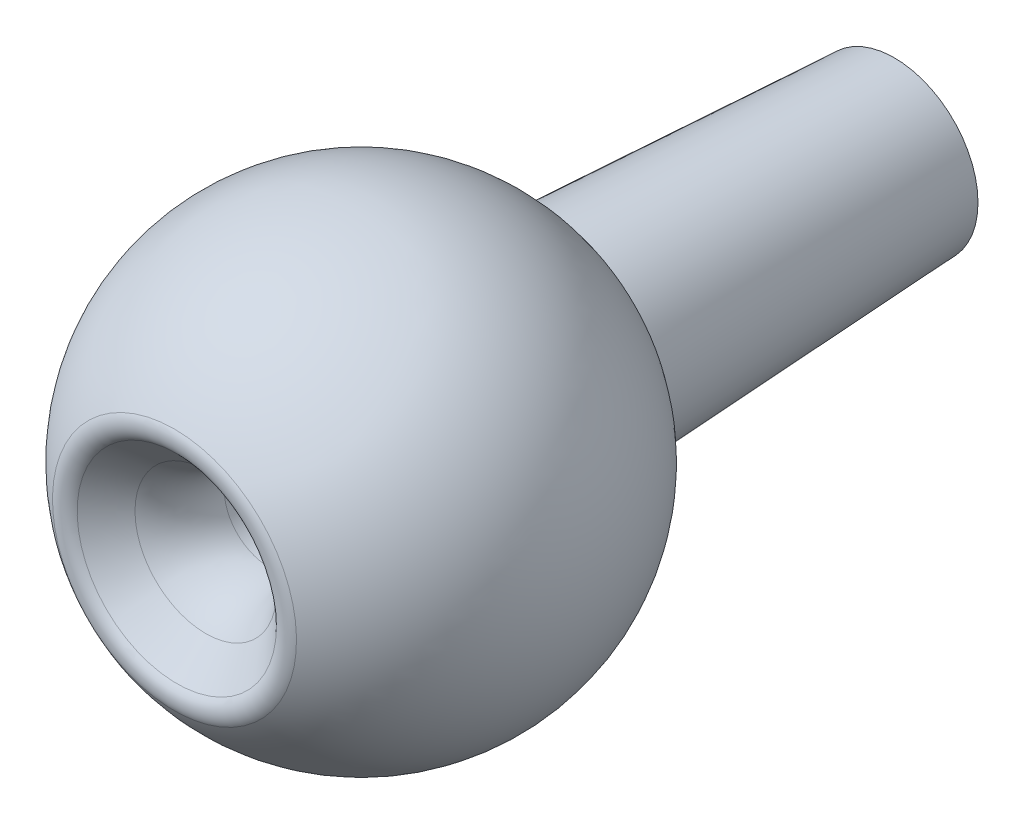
ISO-10303-21;
HEADER;
FILE_DESCRIPTION(('STEP AP214'),'2;1');
FILE_NAME('part.step','',(''),(''),'','','');
FILE_SCHEMA(('AUTOMOTIVE_DESIGN { 1 0 10303 214 1 1 1 1 }'));
ENDSEC;
DATA;
#1=APPLICATION_CONTEXT('core data for automotive mechanical design processes');
#2=APPLICATION_PROTOCOL_DEFINITION('international standard','automotive_design',2000,#1);
#3=PRODUCT_CONTEXT('',#1,'mechanical');
#4=PRODUCT('Part','Part','',(#3));
#5=PRODUCT_RELATED_PRODUCT_CATEGORY('part','',(#4));
#6=PRODUCT_DEFINITION_FORMATION('','',#4);
#7=PRODUCT_DEFINITION_CONTEXT('part definition',#1,'design');
#8=PRODUCT_DEFINITION('design','',#6,#7);
#9=PRODUCT_DEFINITION_SHAPE('','',#8);
#10=(LENGTH_UNIT() NAMED_UNIT(*) SI_UNIT(.MILLI.,.METRE.));
#11=(NAMED_UNIT(*) PLANE_ANGLE_UNIT() SI_UNIT($,.RADIAN.));
#12=(NAMED_UNIT(*) SI_UNIT($,.STERADIAN.) SOLID_ANGLE_UNIT());
#13=UNCERTAINTY_MEASURE_WITH_UNIT(LENGTH_MEASURE(1.E-05),#10,'distance_accuracy_value','');
#14=(GEOMETRIC_REPRESENTATION_CONTEXT(3) GLOBAL_UNCERTAINTY_ASSIGNED_CONTEXT((#13)) GLOBAL_UNIT_ASSIGNED_CONTEXT((#10,
#11,#12)) REPRESENTATION_CONTEXT('',''));
#15=CARTESIAN_POINT('',(0.,0.,0.));
#16=DIRECTION('',(0.,0.,1.));
#17=DIRECTION('',(1.,0.,0.));
#18=AXIS2_PLACEMENT_3D('',#15,#16,#17);
#19=CARTESIAN_POINT('',(0.,0.,0.));
#20=DIRECTION('',(0.,0.,1.));
#21=DIRECTION('',(1.,0.,0.));
#22=AXIS2_PLACEMENT_3D('',#19,#20,#21);
#23=CONICAL_SURFACE('',#22,2.38125,0.05235987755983);
#24=CARTESIAN_POINT('',(0.,0.,9.525));
#25=DIRECTION('',(0.,0.,1.));
#26=DIRECTION('',(1.,0.,0.));
#27=AXIS2_PLACEMENT_3D('',#24,#25,#26);
#28=CIRCLE('',#27,2.88043409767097);
#29=CARTESIAN_POINT('',(0.,2.88043409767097,9.525));
#30=VERTEX_POINT('',#29);
#31=EDGE_CURVE('E51',#30,#30,#28,.T.);
#32=ORIENTED_EDGE('',*,*,#31,.F.);
#33=EDGE_LOOP('',(#32));
#34=FACE_BOUND('',#33,.T.);
#35=CARTESIAN_POINT('',(0.,0.,0.));
#36=DIRECTION('',(0.,0.,1.));
#37=DIRECTION('',(1.,0.,0.));
#38=AXIS2_PLACEMENT_3D('',#35,#36,#37);
#39=CIRCLE('',#38,2.38125);
#40=CARTESIAN_POINT('',(2.38125,0.,0.));
#41=VERTEX_POINT('',#40);
#42=EDGE_CURVE('E54',#41,#41,#39,.T.);
#43=ORIENTED_EDGE('',*,*,#42,.T.);
#44=EDGE_LOOP('',(#43));
#45=FACE_BOUND('',#44,.T.);
#46=ADVANCED_FACE('F31',(#34,#45),#23,.T.);
#47=CARTESIAN_POINT('',(0.,0.,0.));
#48=DIRECTION('',(0.,0.,1.));
#49=DIRECTION('',(1.,0.,0.));
#50=AXIS2_PLACEMENT_3D('',#47,#48,#49);
#51=PLANE('',#50);
#52=CARTESIAN_POINT('',(0.,0.,0.));
#53=DIRECTION('',(0.,0.,-1.));
#54=DIRECTION('',(-1.,0.,0.));
#55=AXIS2_PLACEMENT_3D('',#52,#53,#54);
#56=CIRCLE('',#55,1.27);
#57=CARTESIAN_POINT('',(-1.27,0.,0.));
#58=VERTEX_POINT('',#57);
#59=EDGE_CURVE('E57',#58,#58,#56,.T.);
#60=ORIENTED_EDGE('',*,*,#59,.F.);
#61=EDGE_LOOP('',(#60));
#62=FACE_BOUND('',#61,.T.);
#63=ORIENTED_EDGE('',*,*,#42,.F.);
#64=EDGE_LOOP('',(#63));
#65=FACE_BOUND('',#64,.T.);
#66=ADVANCED_FACE('F63',(#62,#65),#51,.F.);
#67=CARTESIAN_POINT('',(0.,0.,15.1841164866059));
#68=DIRECTION('',(0.,0.,1.));
#69=DIRECTION('',(0.,1.,0.));
#70=AXIS2_PLACEMENT_3D('',#67,#68,#69);
#71=SPHERICAL_SURFACE('',#70,6.35);
#72=CARTESIAN_POINT('',(0.,0.,20.4991905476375));
#73=DIRECTION('',(0.,0.,-1.));
#74=DIRECTION('',(-1.,0.,0.));
#75=AXIS2_PLACEMENT_3D('',#72,#73,#74);
#76=CIRCLE('',#75,3.47454856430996);
#77=CARTESIAN_POINT('',(0.,3.47454856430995,20.4991905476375));
#78=VERTEX_POINT('',#77);
#79=EDGE_CURVE('E38',#78,#78,#76,.T.);
#80=CARTESIAN_POINT('',(0.,3.47454856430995,20.4991905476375));
#81=CARTESIAN_POINT('',(0.,3.59036574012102,20.4234872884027));
#82=CARTESIAN_POINT('',(0.,3.70370032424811,20.3439878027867));
#83=CARTESIAN_POINT('',(0.,3.92493849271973,20.17776031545));
#84=CARTESIAN_POINT('',(0.,4.03284207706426,20.0910323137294));
#85=CARTESIAN_POINT('',(0.,4.24275242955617,19.9107117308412));
#86=CARTESIAN_POINT('',(0.,4.34475919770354,19.8171191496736));
#87=CARTESIAN_POINT('',(0.,4.54244150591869,19.6234709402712));
#88=CARTESIAN_POINT('',(0.,4.63811704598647,19.5234153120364));
#89=CARTESIAN_POINT('',(0.,4.82272786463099,19.317267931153));
#90=CARTESIAN_POINT('',(0.,4.91166314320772,19.2111761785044));
#91=CARTESIAN_POINT('',(0.,5.0824136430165,18.9934098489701));
#92=CARTESIAN_POINT('',(0.,5.16422886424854,18.8817352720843));
#93=CARTESIAN_POINT('',(0.,5.32038974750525,18.6532802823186));
#94=CARTESIAN_POINT('',(0.,5.3947354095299,18.5364998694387));
#95=CARTESIAN_POINT('',(0.,5.53563961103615,18.2983320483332));
#96=CARTESIAN_POINT('',(0.,5.60219815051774,18.1769446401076));
#97=CARTESIAN_POINT('',(0.,5.72724379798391,17.9300813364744));
#98=CARTESIAN_POINT('',(0.,5.7857309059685,17.8046054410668));
#99=CARTESIAN_POINT('',(0.,5.89438386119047,17.5501011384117));
#100=CARTESIAN_POINT('',(0.,5.94454970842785,17.4210727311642));
#101=CARTESIAN_POINT('',(0.,6.03634585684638,17.1600145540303));
#102=CARTESIAN_POINT('',(0.,6.07797615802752,17.0279847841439));
#103=CARTESIAN_POINT('',(0.,6.15252338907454,16.7614878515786));
#104=CARTESIAN_POINT('',(0.,6.18544031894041,16.6270206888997));
#105=CARTESIAN_POINT('',(0.,6.24242020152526,16.3562233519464));
#106=CARTESIAN_POINT('',(0.,6.26648315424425,16.2198931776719));
#107=CARTESIAN_POINT('',(0.,6.30565229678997,15.9459521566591));
#108=CARTESIAN_POINT('',(0.,6.3207584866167,15.8083413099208));
#109=CARTESIAN_POINT('',(0.,6.34194957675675,15.5324267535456));
#110=CARTESIAN_POINT('',(0.,6.34803447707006,15.3941230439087));
#111=CARTESIAN_POINT('',(0.,6.35115699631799,15.1174135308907));
#112=CARTESIAN_POINT('',(0.,6.34819461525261,14.9790077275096));
#113=CARTESIAN_POINT('',(0.,6.33323522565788,14.7026852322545));
#114=CARTESIAN_POINT('',(0.,6.32123821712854,14.5647685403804));
#115=CARTESIAN_POINT('',(0.,6.28826081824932,14.2900133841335));
#116=CARTESIAN_POINT('',(0.,6.26728042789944,14.1531749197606));
#117=CARTESIAN_POINT('',(0.,6.21642588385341,13.881160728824));
#118=CARTESIAN_POINT('',(0.,6.18655173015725,13.7459850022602));
#119=CARTESIAN_POINT('',(0.,6.1180372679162,13.4778736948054));
#120=CARTESIAN_POINT('',(0.,6.0793969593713,13.3449381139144));
#121=CARTESIAN_POINT('',(0.,5.993515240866,13.0818749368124));
#122=CARTESIAN_POINT('',(0.,5.94627383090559,12.9517473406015));
#123=CARTESIAN_POINT('',(0.,5.84339170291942,12.6948559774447));
#124=CARTESIAN_POINT('',(0.,5.78775098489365,12.568092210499));
#125=CARTESIAN_POINT('',(0.,5.66830791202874,12.3184699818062));
#126=CARTESIAN_POINT('',(0.,5.6045055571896,12.1956115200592));
#127=CARTESIAN_POINT('',(0.,5.46901174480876,11.9543246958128));
#128=CARTESIAN_POINT('',(0.,5.39732028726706,11.8358963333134));
#129=CARTESIAN_POINT('',(0.,5.24635450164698,11.6039755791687));
#130=CARTESIAN_POINT('',(0.,5.16708017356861,11.4904831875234));
#131=CARTESIAN_POINT('',(0.,5.00128727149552,11.2689191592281));
#132=CARTESIAN_POINT('',(0.,4.91476869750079,11.1608475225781));
#133=CARTESIAN_POINT('',(0.,4.73485686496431,10.9505866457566));
#134=CARTESIAN_POINT('',(0.,4.64146360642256,10.8483974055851));
#135=CARTESIAN_POINT('',(0.,4.44820135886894,10.6503377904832));
#136=CARTESIAN_POINT('',(0.,4.34833236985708,10.5544674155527));
#137=CARTESIAN_POINT('',(0.,4.14254517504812,10.3694551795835));
#138=CARTESIAN_POINT('',(0.,4.03662696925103,10.2803133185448));
#139=CARTESIAN_POINT('',(0.,3.81919407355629,10.1091383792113));
#140=CARTESIAN_POINT('',(0.,3.70767938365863,10.0271053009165));
#141=CARTESIAN_POINT('',(0.,3.47952874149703,9.87050021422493));
#142=CARTESIAN_POINT('',(0.,3.36289278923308,9.79592820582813));
#143=CARTESIAN_POINT('',(0.,3.12500200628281,9.65455677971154));
#144=CARTESIAN_POINT('',(0.,3.0037471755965,9.58775736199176));
#145=CARTESIAN_POINT('',(0.,2.88043409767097,9.525));
#146=B_SPLINE_CURVE_WITH_KNOTS('',3,(#80,#81,#82,#83,#84,#85,#86,#87,#88,#89,#90,#91,#92,#93,
#94,#95,#96,#97,#98,#99,#100,#101,#102,#103,#104,#105,#106,#107,#108,#109,#110,#111,#112,#113,
#114,#115,#116,#117,#118,#119,#120,#121,#122,#123,#124,#125,#126,#127,#128,#129,#130,#131,#132,
#133,#134,#135,#136,#137,#138,#139,#140,#141,#142,#143,#144,#145),.UNSPECIFIED.,.F.,.F.,(4,2,2,
2,2,2,2,2,2,2,2,2,2,2,2,2,2,2,2,2,2,2,2,2,2,2,2,2,2,2,2,2,4),(0.,0.41501683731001,
0.83003367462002,1.24505051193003,1.66006734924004,2.07508418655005,2.49010102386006,
2.90511786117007,3.32013469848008,3.73515153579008,4.15016837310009,4.5651852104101,
4.98020204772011,5.39521888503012,5.81023572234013,6.22525255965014,6.64026939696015,
7.05528623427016,7.47030307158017,7.88531990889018,8.30033674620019,8.7153535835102,
9.1303704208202,9.54538725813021,9.96040409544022,10.3754209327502,10.7904377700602,
11.2054546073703,11.6204714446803,12.0354882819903,12.4505051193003,12.8655219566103,
13.2805387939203),.UNSPECIFIED.);
#147=EDGE_CURVE('BSEAM66',#78,#30,#146,.T.);
#148=ORIENTED_EDGE('',*,*,#79,.T.);
#149=ORIENTED_EDGE('',*,*,#31,.T.);
#150=ORIENTED_EDGE('',*,*,#147,.T.);
#151=ORIENTED_EDGE('',*,*,#147,.F.);
#152=EDGE_LOOP('',(#148,#150,#149,#151));
#153=FACE_BOUND('',#152,.T.);
#154=ADVANCED_FACE('F66',(#153),#71,.T.);
#155=CARTESIAN_POINT('',(0.,0.,21.5341164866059));
#156=DIRECTION('',(0.,0.,-1.));
#157=DIRECTION('',(-1.,0.,0.));
#158=AXIS2_PLACEMENT_3D('',#155,#156,#157);
#159=CYLINDRICAL_SURFACE('',#158,1.27);
#160=CARTESIAN_POINT('',(0.,0.,17.8137179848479));
#161=DIRECTION('',(0.,0.,-1.));
#162=DIRECTION('',(-1.,0.,0.));
#163=AXIS2_PLACEMENT_3D('',#160,#161,#162);
#164=CIRCLE('',#163,1.27);
#165=CARTESIAN_POINT('',(-1.27,0.,17.8137179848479));
#166=VERTEX_POINT('',#165);
#167=EDGE_CURVE('E46',#166,#166,#164,.F.);
#168=ORIENTED_EDGE('',*,*,#167,.T.);
#169=EDGE_LOOP('',(#168));
#170=FACE_BOUND('',#169,.T.);
#171=ORIENTED_EDGE('',*,*,#59,.T.);
#172=EDGE_LOOP('',(#171));
#173=FACE_BOUND('',#172,.T.);
#174=ADVANCED_FACE('F61',(#170,#173),#159,.F.);
#175=CARTESIAN_POINT('',(0.,0.,20.7151471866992));
#176=DIRECTION('',(0.,0.,1.));
#177=DIRECTION('',(1.,0.,0.));
#178=AXIS2_PLACEMENT_3D('',#175,#176,#177);
#179=CONICAL_SURFACE('',#178,3.11932675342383,0.78539816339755);
#180=CARTESIAN_POINT('',(0.,0.,20.4331948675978));
#181=DIRECTION('',(0.,0.,1.));
#182=DIRECTION('',(1.,0.,0.));
#183=AXIS2_PLACEMENT_3D('',#180,#181,#182);
#184=CIRCLE('',#183,2.83737443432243);
#185=CARTESIAN_POINT('',(2.83737443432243,0.,20.4331948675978));
#186=VERTEX_POINT('',#185);
#187=EDGE_CURVE('E10',#186,#186,#184,.T.);
#188=ORIENTED_EDGE('',*,*,#187,.T.);
#189=EDGE_LOOP('',(#188));
#190=FACE_BOUND('',#189,.T.);
#191=CARTESIAN_POINT('',(0.,0.,19.6097692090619));
#192=DIRECTION('',(0.,0.,1.));
#193=DIRECTION('',(1.,0.,0.));
#194=AXIS2_PLACEMENT_3D('',#191,#192,#193);
#195=CIRCLE('',#194,2.01394877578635);
#196=CARTESIAN_POINT('',(2.01394877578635,0.,19.6097692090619));
#197=VERTEX_POINT('',#196);
#198=EDGE_CURVE('E42',#197,#197,#195,.F.);
#199=ORIENTED_EDGE('',*,*,#198,.T.);
#200=EDGE_LOOP('',(#199));
#201=FACE_BOUND('',#200,.T.);
#202=ADVANCED_FACE('F78',(#190,#201),#179,.F.);
#203=CARTESIAN_POINT('',(0.,0.,17.8137179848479));
#204=DIRECTION('',(0.,0.,-1.));
#205=DIRECTION('',(-1.,0.,0.));
#206=AXIS2_PLACEMENT_3D('',#203,#204,#205);
#207=TOROIDAL_SURFACE('',#206,3.81,2.54);
#208=ORIENTED_EDGE('',*,*,#198,.F.);
#209=EDGE_LOOP('',(#208));
#210=FACE_BOUND('',#209,.T.);
#211=ORIENTED_EDGE('',*,*,#167,.F.);
#212=EDGE_LOOP('',(#211));
#213=FACE_BOUND('',#212,.T.);
#214=ADVANCED_FACE('F80',(#210,#213),#207,.T.);
#215=CARTESIAN_POINT('',(0.,0.,20.073984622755));
#216=DIRECTION('',(0.,0.,-1.));
#217=DIRECTION('',(-1.,0.,0.));
#218=AXIS2_PLACEMENT_3D('',#215,#216,#217);
#219=TOROIDAL_SURFACE('',#218,3.19658467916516,0.508);
#220=ORIENTED_EDGE('',*,*,#187,.F.);
#221=EDGE_LOOP('',(#220));
#222=FACE_BOUND('',#221,.T.);
#223=ORIENTED_EDGE('',*,*,#79,.F.);
#224=EDGE_LOOP('',(#223));
#225=FACE_BOUND('',#224,.T.);
#226=ADVANCED_FACE('F33',(#222,#225),#219,.T.);
#227=CLOSED_SHELL('',(#46,#66,#154,#174,#202,#214,#226));
#228=MANIFOLD_SOLID_BREP('B2',#227);
#229=ADVANCED_BREP_SHAPE_REPRESENTATION('',(#18,#228),#14);
#230=SHAPE_DEFINITION_REPRESENTATION(#9,#229);
ENDSEC;
END-ISO-10303-21;
